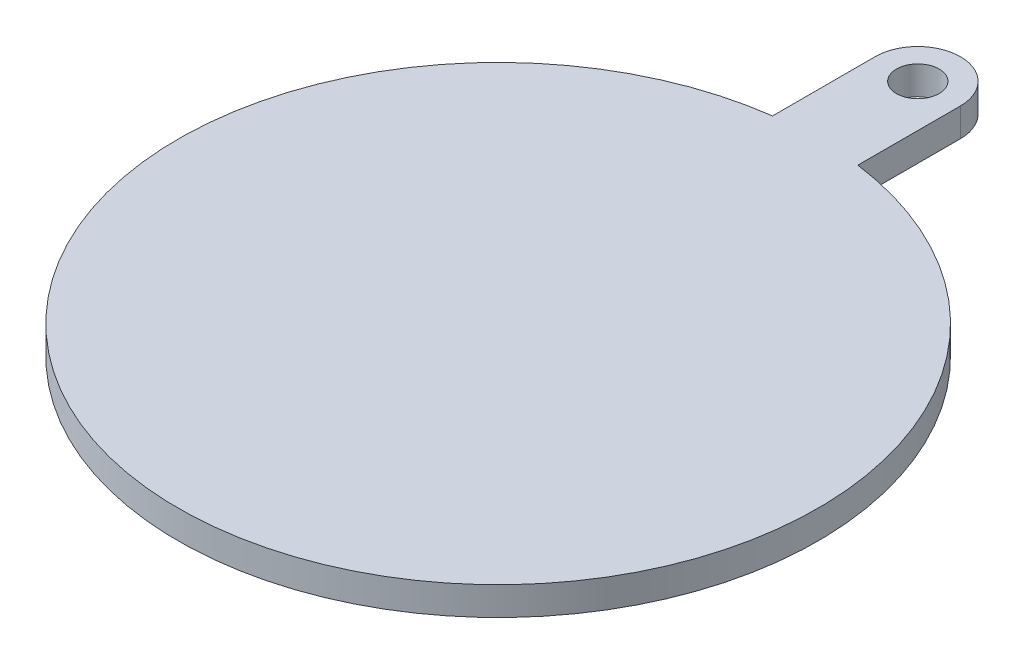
from build123d import *

# Parameters (mm, degrees)
SKETCH_1_R      = 1.5
EXTRUDE_1_DEPTH = 2


with BuildPart() as part:
    # Sketch 1 → Extrude 1 (new body)
    with BuildSketch(Plane(origin=(0, 0, 0), x_dir=(1, 0, 0), z_dir=(0, 1, 0))):
        with BuildLine():
            ThreePointArc((3, 29.516295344), (0, 32.516295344), (-3, 29.516295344))
            Line((-3, 29.516295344), (-3, 22.299103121))
            ThreePointArc((-3, 22.299103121), (0, -22.5), (3, 22.299103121))
            Line((3, 22.299103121), (3, 29.516295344))
        make_face()
        with Locations(Location((0, 29.516295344, 0), (0, 0, 270))):
            Circle(SKETCH_1_R, mode=Mode.SUBTRACT)
    extrude(amount=EXTRUDE_1_DEPTH)


solid = part.part
